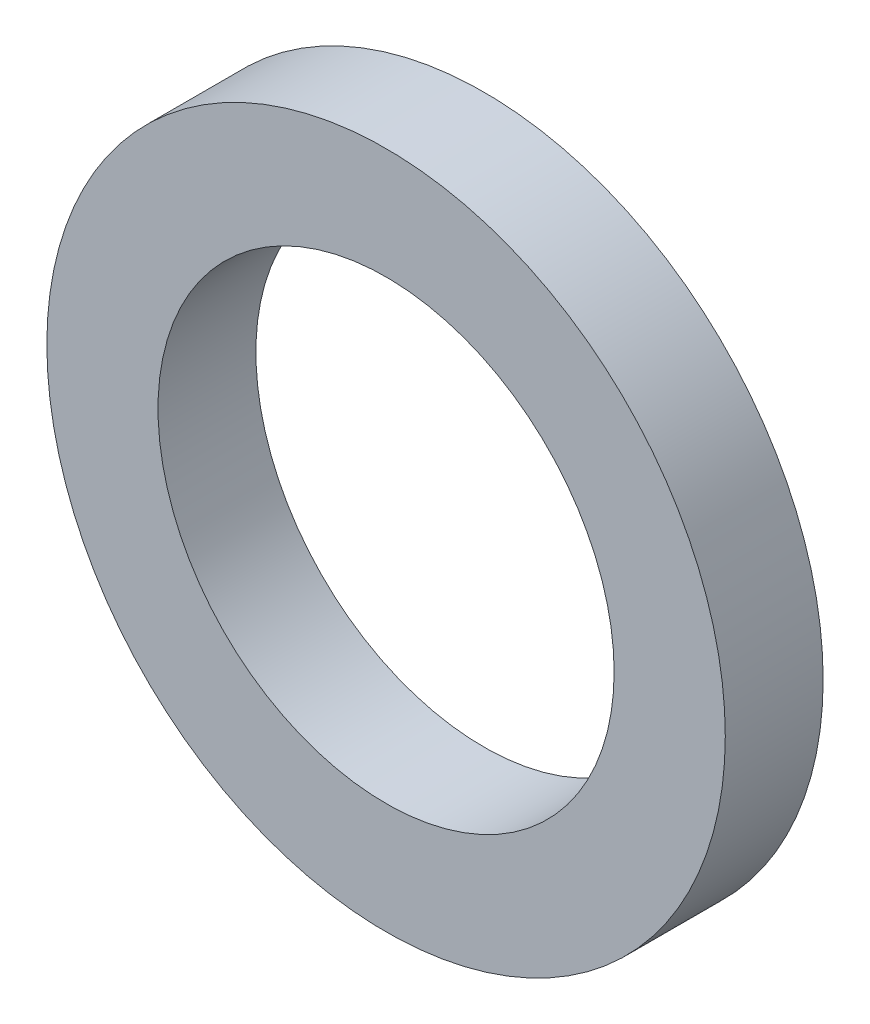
from build123d import *

# Parameters (mm, degrees)
SKETCH1_R      = 8.255
EXTRUDE1_DEPTH = 1.190625
HOLE1_D        = 11.0998


with BuildPart() as part:
    # Sketch1 → Extrude1 (new, symmetric)
    with BuildSketch(Plane.XY):
        with Locations(Location((0, 0, 0), (0, 0, 180))):
            Circle(SKETCH1_R)
    extrude(amount=EXTRUDE1_DEPTH, both=True)

    # Hole1 (through all)
    with Locations(Plane.XY.offset(1.190625)):
        with Locations((0, 0)):
            Hole(HOLE1_D / 2)


solid = part.part
